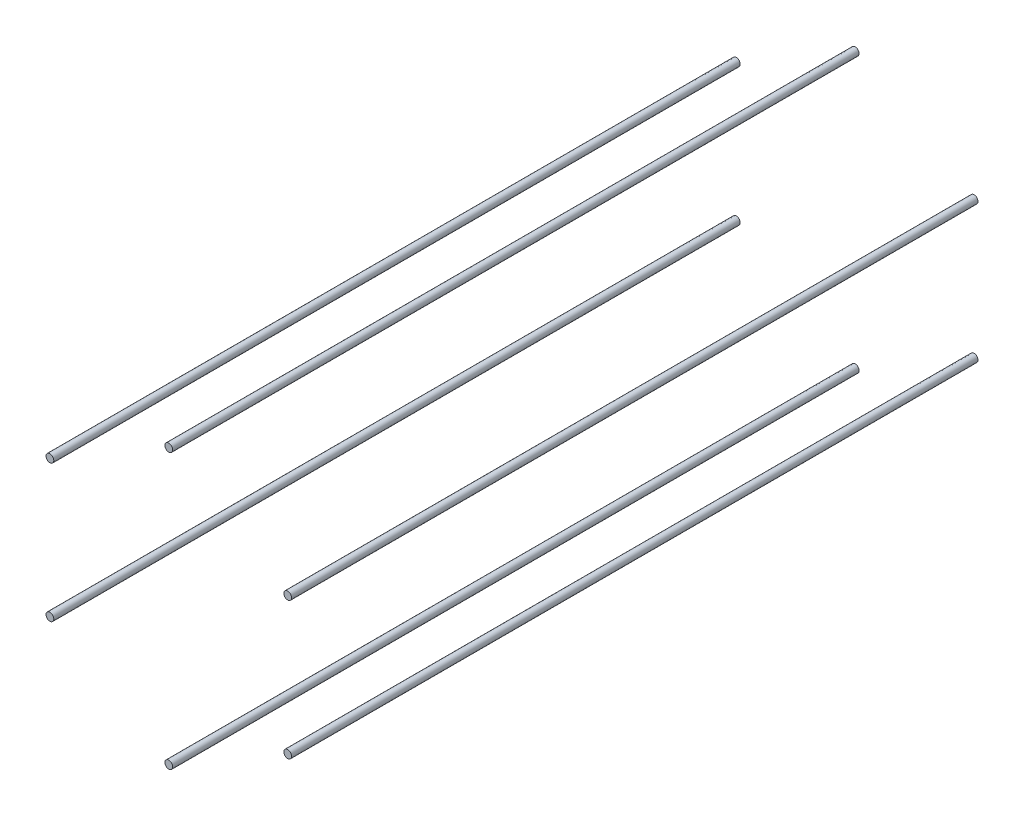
ISO-10303-21;
HEADER;
FILE_DESCRIPTION(('STEP AP214'),'2;1');
FILE_NAME('part.step','',(''),(''),'','','');
FILE_SCHEMA(('AUTOMOTIVE_DESIGN { 1 0 10303 214 1 1 1 1 }'));
ENDSEC;
DATA;
#1=APPLICATION_CONTEXT('core data for automotive mechanical design processes');
#2=APPLICATION_PROTOCOL_DEFINITION('international standard','automotive_design',2000,#1);
#3=PRODUCT_CONTEXT('',#1,'mechanical');
#4=PRODUCT('Part','Part','',(#3));
#5=PRODUCT_RELATED_PRODUCT_CATEGORY('part','',(#4));
#6=PRODUCT_DEFINITION_FORMATION('','',#4);
#7=PRODUCT_DEFINITION_CONTEXT('part definition',#1,'design');
#8=PRODUCT_DEFINITION('design','',#6,#7);
#9=PRODUCT_DEFINITION_SHAPE('','',#8);
#10=(LENGTH_UNIT() NAMED_UNIT(*) SI_UNIT(.MILLI.,.METRE.));
#11=(NAMED_UNIT(*) PLANE_ANGLE_UNIT() SI_UNIT($,.RADIAN.));
#12=(NAMED_UNIT(*) SI_UNIT($,.STERADIAN.) SOLID_ANGLE_UNIT());
#13=UNCERTAINTY_MEASURE_WITH_UNIT(LENGTH_MEASURE(1.E-05),#10,'distance_accuracy_value','');
#14=(GEOMETRIC_REPRESENTATION_CONTEXT(3) GLOBAL_UNCERTAINTY_ASSIGNED_CONTEXT((#13)) GLOBAL_UNIT_ASSIGNED_CONTEXT((#10,
#11,#12)) REPRESENTATION_CONTEXT('',''));
#15=CARTESIAN_POINT('',(0.,0.,0.));
#16=DIRECTION('',(0.,0.,1.));
#17=DIRECTION('',(1.,0.,0.));
#18=AXIS2_PLACEMENT_3D('',#15,#16,#17);
#19=CARTESIAN_POINT('',(-193.581536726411,111.764352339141,558.799999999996));
#20=DIRECTION('',(0.,0.,-1.));
#21=DIRECTION('',(-1.,0.,0.));
#22=AXIS2_PLACEMENT_3D('',#19,#20,#21);
#23=CYLINDRICAL_SURFACE('',#22,6.34999999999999);
#24=CARTESIAN_POINT('',(-193.581536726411,111.764352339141,558.799999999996));
#25=DIRECTION('',(0.,0.,1.));
#26=DIRECTION('',(1.,0.,0.));
#27=AXIS2_PLACEMENT_3D('',#24,#25,#26);
#28=CIRCLE('',#27,6.34999999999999);
#29=CARTESIAN_POINT('',(-187.231536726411,111.764352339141,558.799999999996));
#30=VERTEX_POINT('',#29);
#31=EDGE_CURVE('E52',#30,#30,#28,.T.);
#32=ORIENTED_EDGE('',*,*,#31,.F.);
#33=EDGE_LOOP('',(#32));
#34=FACE_BOUND('',#33,.T.);
#35=CARTESIAN_POINT('',(-193.581536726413,111.764352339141,-558.8));
#36=DIRECTION('',(0.,0.,1.));
#37=DIRECTION('',(1.,0.,0.));
#38=AXIS2_PLACEMENT_3D('',#35,#36,#37);
#39=CIRCLE('',#38,6.34999999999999);
#40=CARTESIAN_POINT('',(-187.231536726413,111.764352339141,-558.8));
#41=VERTEX_POINT('',#40);
#42=EDGE_CURVE('E11',#41,#41,#39,.T.);
#43=ORIENTED_EDGE('',*,*,#42,.T.);
#44=EDGE_LOOP('',(#43));
#45=FACE_BOUND('',#44,.T.);
#46=ADVANCED_FACE('F48',(#34,#45),#23,.T.);
#47=CARTESIAN_POINT('',(-193.581536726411,111.764352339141,558.799999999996));
#48=DIRECTION('',(0.,0.,1.));
#49=DIRECTION('',(1.,0.,0.));
#50=AXIS2_PLACEMENT_3D('',#47,#48,#49);
#51=PLANE('',#50);
#52=ORIENTED_EDGE('',*,*,#31,.T.);
#53=EDGE_LOOP('',(#52));
#54=FACE_BOUND('',#53,.T.);
#55=ADVANCED_FACE('F50',(#54),#51,.T.);
#56=CARTESIAN_POINT('',(-193.581536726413,111.764352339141,-558.8));
#57=DIRECTION('',(0.,0.,1.));
#58=DIRECTION('',(1.,0.,0.));
#59=AXIS2_PLACEMENT_3D('',#56,#57,#58);
#60=PLANE('',#59);
#61=ORIENTED_EDGE('',*,*,#42,.F.);
#62=EDGE_LOOP('',(#61));
#63=FACE_BOUND('',#62,.T.);
#64=ADVANCED_FACE('F72',(#63),#60,.F.);
#65=CLOSED_SHELL('',(#46,#55,#64));
#66=MANIFOLD_SOLID_BREP('B2',#65);
#67=CARTESIAN_POINT('',(-193.581536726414,-111.764352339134,558.799999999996));
#68=DIRECTION('',(0.,0.,-1.));
#69=DIRECTION('',(-1.,0.,0.));
#70=AXIS2_PLACEMENT_3D('',#67,#68,#69);
#71=CYLINDRICAL_SURFACE('',#70,6.35);
#72=CARTESIAN_POINT('',(-193.581536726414,-111.764352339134,558.799999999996));
#73=DIRECTION('',(0.,0.,1.));
#74=DIRECTION('',(1.,0.,0.));
#75=AXIS2_PLACEMENT_3D('',#72,#73,#74);
#76=CIRCLE('',#75,6.35);
#77=CARTESIAN_POINT('',(-187.231536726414,-111.764352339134,558.799999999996));
#78=VERTEX_POINT('',#77);
#79=EDGE_CURVE('E99',#78,#78,#76,.T.);
#80=ORIENTED_EDGE('',*,*,#79,.F.);
#81=EDGE_LOOP('',(#80));
#82=FACE_BOUND('',#81,.T.);
#83=CARTESIAN_POINT('',(-193.581536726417,-111.764352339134,-558.8));
#84=DIRECTION('',(0.,0.,1.));
#85=DIRECTION('',(1.,0.,0.));
#86=AXIS2_PLACEMENT_3D('',#83,#84,#85);
#87=CIRCLE('',#86,6.35);
#88=CARTESIAN_POINT('',(-187.231536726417,-111.764352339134,-558.8));
#89=VERTEX_POINT('',#88);
#90=EDGE_CURVE('E47',#89,#89,#87,.T.);
#91=ORIENTED_EDGE('',*,*,#90,.T.);
#92=EDGE_LOOP('',(#91));
#93=FACE_BOUND('',#92,.T.);
#94=ADVANCED_FACE('F95',(#82,#93),#71,.T.);
#95=CARTESIAN_POINT('',(-193.581536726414,-111.764352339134,558.799999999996));
#96=DIRECTION('',(0.,0.,1.));
#97=DIRECTION('',(1.,0.,0.));
#98=AXIS2_PLACEMENT_3D('',#95,#96,#97);
#99=PLANE('',#98);
#100=ORIENTED_EDGE('',*,*,#79,.T.);
#101=EDGE_LOOP('',(#100));
#102=FACE_BOUND('',#101,.T.);
#103=ADVANCED_FACE('F97',(#102),#99,.T.);
#104=CARTESIAN_POINT('',(-193.581536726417,-111.764352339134,-558.8));
#105=DIRECTION('',(0.,0.,1.));
#106=DIRECTION('',(1.,0.,0.));
#107=AXIS2_PLACEMENT_3D('',#104,#105,#106);
#108=PLANE('',#107);
#109=ORIENTED_EDGE('',*,*,#90,.F.);
#110=EDGE_LOOP('',(#109));
#111=FACE_BOUND('',#110,.T.);
#112=ADVANCED_FACE('F119',(#111),#108,.F.);
#113=CLOSED_SHELL('',(#94,#103,#112));
#114=MANIFOLD_SOLID_BREP('B6',#113);
#115=CARTESIAN_POINT('',(-2.88657986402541E-12,-223.528704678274,558.799999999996));
#116=DIRECTION('',(0.,0.,-1.));
#117=DIRECTION('',(-1.,0.,0.));
#118=AXIS2_PLACEMENT_3D('',#115,#116,#117);
#119=CYLINDRICAL_SURFACE('',#118,6.34999999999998);
#120=CARTESIAN_POINT('',(-2.88657986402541E-12,-223.528704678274,558.799999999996));
#121=DIRECTION('',(0.,0.,1.));
#122=DIRECTION('',(1.,0.,0.));
#123=AXIS2_PLACEMENT_3D('',#120,#121,#122);
#124=CIRCLE('',#123,6.34999999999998);
#125=CARTESIAN_POINT('',(6.3499999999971,-223.528704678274,558.799999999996));
#126=VERTEX_POINT('',#125);
#127=EDGE_CURVE('E146',#126,#126,#124,.T.);
#128=ORIENTED_EDGE('',*,*,#127,.F.);
#129=EDGE_LOOP('',(#128));
#130=FACE_BOUND('',#129,.T.);
#131=CARTESIAN_POINT('',(-2.55351295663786E-12,-223.528704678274,-558.8));
#132=DIRECTION('',(0.,0.,1.));
#133=DIRECTION('',(1.,0.,0.));
#134=AXIS2_PLACEMENT_3D('',#131,#132,#133);
#135=CIRCLE('',#134,6.34999999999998);
#136=CARTESIAN_POINT('',(6.34999999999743,-223.528704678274,-558.8));
#137=VERTEX_POINT('',#136);
#138=EDGE_CURVE('E94',#137,#137,#135,.T.);
#139=ORIENTED_EDGE('',*,*,#138,.T.);
#140=EDGE_LOOP('',(#139));
#141=FACE_BOUND('',#140,.T.);
#142=ADVANCED_FACE('F142',(#130,#141),#119,.T.);
#143=CARTESIAN_POINT('',(-2.88657986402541E-12,-223.528704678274,558.799999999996));
#144=DIRECTION('',(0.,0.,1.));
#145=DIRECTION('',(1.,0.,0.));
#146=AXIS2_PLACEMENT_3D('',#143,#144,#145);
#147=PLANE('',#146);
#148=ORIENTED_EDGE('',*,*,#127,.T.);
#149=EDGE_LOOP('',(#148));
#150=FACE_BOUND('',#149,.T.);
#151=ADVANCED_FACE('F144',(#150),#147,.T.);
#152=CARTESIAN_POINT('',(-2.55351295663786E-12,-223.528704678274,-558.8));
#153=DIRECTION('',(0.,0.,1.));
#154=DIRECTION('',(1.,0.,0.));
#155=AXIS2_PLACEMENT_3D('',#152,#153,#154);
#156=PLANE('',#155);
#157=ORIENTED_EDGE('',*,*,#138,.F.);
#158=EDGE_LOOP('',(#157));
#159=FACE_BOUND('',#158,.T.);
#160=ADVANCED_FACE('F166',(#159),#156,.F.);
#161=CLOSED_SHELL('',(#142,#151,#160));
#162=MANIFOLD_SOLID_BREP('B42',#161);
#163=CARTESIAN_POINT('',(193.581536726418,-111.764352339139,558.8));
#164=DIRECTION('',(0.,0.,-1.));
#165=DIRECTION('',(-1.,0.,0.));
#166=AXIS2_PLACEMENT_3D('',#163,#164,#165);
#167=CYLINDRICAL_SURFACE('',#166,6.34999999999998);
#168=CARTESIAN_POINT('',(193.581536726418,-111.764352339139,558.8));
#169=DIRECTION('',(0.,0.,1.));
#170=DIRECTION('',(1.,0.,0.));
#171=AXIS2_PLACEMENT_3D('',#168,#169,#170);
#172=CIRCLE('',#171,6.34999999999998);
#173=CARTESIAN_POINT('',(199.931536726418,-111.764352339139,558.8));
#174=VERTEX_POINT('',#173);
#175=EDGE_CURVE('E193',#174,#174,#172,.T.);
#176=ORIENTED_EDGE('',*,*,#175,.F.);
#177=EDGE_LOOP('',(#176));
#178=FACE_BOUND('',#177,.T.);
#179=CARTESIAN_POINT('',(193.581536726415,-111.764352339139,-558.8));
#180=DIRECTION('',(0.,0.,1.));
#181=DIRECTION('',(1.,0.,0.));
#182=AXIS2_PLACEMENT_3D('',#179,#180,#181);
#183=CIRCLE('',#182,6.34999999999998);
#184=CARTESIAN_POINT('',(199.931536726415,-111.764352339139,-558.8));
#185=VERTEX_POINT('',#184);
#186=EDGE_CURVE('E141',#185,#185,#183,.T.);
#187=ORIENTED_EDGE('',*,*,#186,.T.);
#188=EDGE_LOOP('',(#187));
#189=FACE_BOUND('',#188,.T.);
#190=ADVANCED_FACE('F189',(#178,#189),#167,.T.);
#191=CARTESIAN_POINT('',(193.581536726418,-111.764352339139,558.8));
#192=DIRECTION('',(0.,0.,1.));
#193=DIRECTION('',(1.,0.,0.));
#194=AXIS2_PLACEMENT_3D('',#191,#192,#193);
#195=PLANE('',#194);
#196=ORIENTED_EDGE('',*,*,#175,.T.);
#197=EDGE_LOOP('',(#196));
#198=FACE_BOUND('',#197,.T.);
#199=ADVANCED_FACE('F191',(#198),#195,.T.);
#200=CARTESIAN_POINT('',(193.581536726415,-111.764352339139,-558.8));
#201=DIRECTION('',(0.,0.,1.));
#202=DIRECTION('',(1.,0.,0.));
#203=AXIS2_PLACEMENT_3D('',#200,#201,#202);
#204=PLANE('',#203);
#205=ORIENTED_EDGE('',*,*,#186,.F.);
#206=EDGE_LOOP('',(#205));
#207=FACE_BOUND('',#206,.T.);
#208=ADVANCED_FACE('F213',(#207),#204,.F.);
#209=CLOSED_SHELL('',(#190,#199,#208));
#210=MANIFOLD_SOLID_BREP('B89',#209);
#211=CARTESIAN_POINT('',(193.581536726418,111.764352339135,558.8));
#212=DIRECTION('',(0.,0.,-1.));
#213=DIRECTION('',(-1.,0.,0.));
#214=AXIS2_PLACEMENT_3D('',#211,#212,#213);
#215=CYLINDRICAL_SURFACE('',#214,6.35);
#216=CARTESIAN_POINT('',(193.581536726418,111.764352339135,558.8));
#217=DIRECTION('',(0.,0.,1.));
#218=DIRECTION('',(1.,0.,0.));
#219=AXIS2_PLACEMENT_3D('',#216,#217,#218);
#220=CIRCLE('',#219,6.35);
#221=CARTESIAN_POINT('',(199.931536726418,111.764352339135,558.8));
#222=VERTEX_POINT('',#221);
#223=EDGE_CURVE('E239',#222,#222,#220,.T.);
#224=ORIENTED_EDGE('',*,*,#223,.F.);
#225=EDGE_LOOP('',(#224));
#226=FACE_BOUND('',#225,.T.);
#227=CARTESIAN_POINT('',(193.581536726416,111.764352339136,-558.800000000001));
#228=DIRECTION('',(0.,0.,1.));
#229=DIRECTION('',(1.,0.,0.));
#230=AXIS2_PLACEMENT_3D('',#227,#228,#229);
#231=CIRCLE('',#230,6.35);
#232=CARTESIAN_POINT('',(199.931536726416,111.764352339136,-558.800000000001));
#233=VERTEX_POINT('',#232);
#234=EDGE_CURVE('E188',#233,#233,#231,.T.);
#235=ORIENTED_EDGE('',*,*,#234,.T.);
#236=EDGE_LOOP('',(#235));
#237=FACE_BOUND('',#236,.T.);
#238=ADVANCED_FACE('F235',(#226,#237),#215,.T.);
#239=CARTESIAN_POINT('',(193.581536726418,111.764352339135,558.8));
#240=DIRECTION('',(0.,0.,1.));
#241=DIRECTION('',(1.,0.,0.));
#242=AXIS2_PLACEMENT_3D('',#239,#240,#241);
#243=PLANE('',#242);
#244=ORIENTED_EDGE('',*,*,#223,.T.);
#245=EDGE_LOOP('',(#244));
#246=FACE_BOUND('',#245,.T.);
#247=ADVANCED_FACE('F237',(#246),#243,.T.);
#248=CARTESIAN_POINT('',(193.581536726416,111.764352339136,-558.800000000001));
#249=DIRECTION('',(0.,0.,1.));
#250=DIRECTION('',(1.,0.,0.));
#251=AXIS2_PLACEMENT_3D('',#248,#249,#250);
#252=PLANE('',#251);
#253=ORIENTED_EDGE('',*,*,#234,.F.);
#254=EDGE_LOOP('',(#253));
#255=FACE_BOUND('',#254,.T.);
#256=ADVANCED_FACE('F259',(#255),#252,.F.);
#257=CLOSED_SHELL('',(#238,#247,#256));
#258=MANIFOLD_SOLID_BREP('B136',#257);
#259=CARTESIAN_POINT('',(0.,223.528704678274,558.799999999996));
#260=DIRECTION('',(0.,0.,-1.));
#261=DIRECTION('',(-1.,0.,0.));
#262=AXIS2_PLACEMENT_3D('',#259,#260,#261);
#263=CYLINDRICAL_SURFACE('',#262,6.35);
#264=CARTESIAN_POINT('',(0.,223.528704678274,558.799999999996));
#265=DIRECTION('',(0.,0.,1.));
#266=DIRECTION('',(1.,0.,0.));
#267=AXIS2_PLACEMENT_3D('',#264,#265,#266);
#268=CIRCLE('',#267,6.35);
#269=CARTESIAN_POINT('',(6.35,223.528704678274,558.799999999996));
#270=VERTEX_POINT('',#269);
#271=EDGE_CURVE('E234',#270,#270,#268,.T.);
#272=ORIENTED_EDGE('',*,*,#271,.F.);
#273=EDGE_LOOP('',(#272));
#274=FACE_BOUND('',#273,.T.);
#275=CARTESIAN_POINT('',(3.33066907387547E-13,223.528704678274,-558.8));
#276=DIRECTION('',(0.,0.,1.));
#277=DIRECTION('',(1.,0.,0.));
#278=AXIS2_PLACEMENT_3D('',#275,#276,#277);
#279=CIRCLE('',#278,6.35);
#280=CARTESIAN_POINT('',(6.35000000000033,223.528704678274,-558.8));
#281=VERTEX_POINT('',#280);
#282=EDGE_CURVE('E277',#281,#281,#279,.T.);
#283=ORIENTED_EDGE('',*,*,#282,.T.);
#284=EDGE_LOOP('',(#283));
#285=FACE_BOUND('',#284,.T.);
#286=ADVANCED_FACE('F274',(#274,#285),#263,.T.);
#287=CARTESIAN_POINT('',(0.,223.528704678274,558.799999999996));
#288=DIRECTION('',(0.,0.,1.));
#289=DIRECTION('',(1.,0.,0.));
#290=AXIS2_PLACEMENT_3D('',#287,#288,#289);
#291=PLANE('',#290);
#292=ORIENTED_EDGE('',*,*,#271,.T.);
#293=EDGE_LOOP('',(#292));
#294=FACE_BOUND('',#293,.T.);
#295=ADVANCED_FACE('F293',(#294),#291,.T.);
#296=CARTESIAN_POINT('',(3.33066907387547E-13,223.528704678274,-558.8));
#297=DIRECTION('',(0.,0.,1.));
#298=DIRECTION('',(1.,0.,0.));
#299=AXIS2_PLACEMENT_3D('',#296,#297,#298);
#300=PLANE('',#299);
#301=ORIENTED_EDGE('',*,*,#282,.F.);
#302=EDGE_LOOP('',(#301));
#303=FACE_BOUND('',#302,.T.);
#304=ADVANCED_FACE('F291',(#303),#300,.F.);
#305=CLOSED_SHELL('',(#286,#295,#304));
#306=MANIFOLD_SOLID_BREP('B183',#305);
#307=ADVANCED_BREP_SHAPE_REPRESENTATION('',(#18,#66,#114,#162,#210,#258,#306),#14);
#308=SHAPE_DEFINITION_REPRESENTATION(#9,#307);
ENDSEC;
END-ISO-10303-21;
